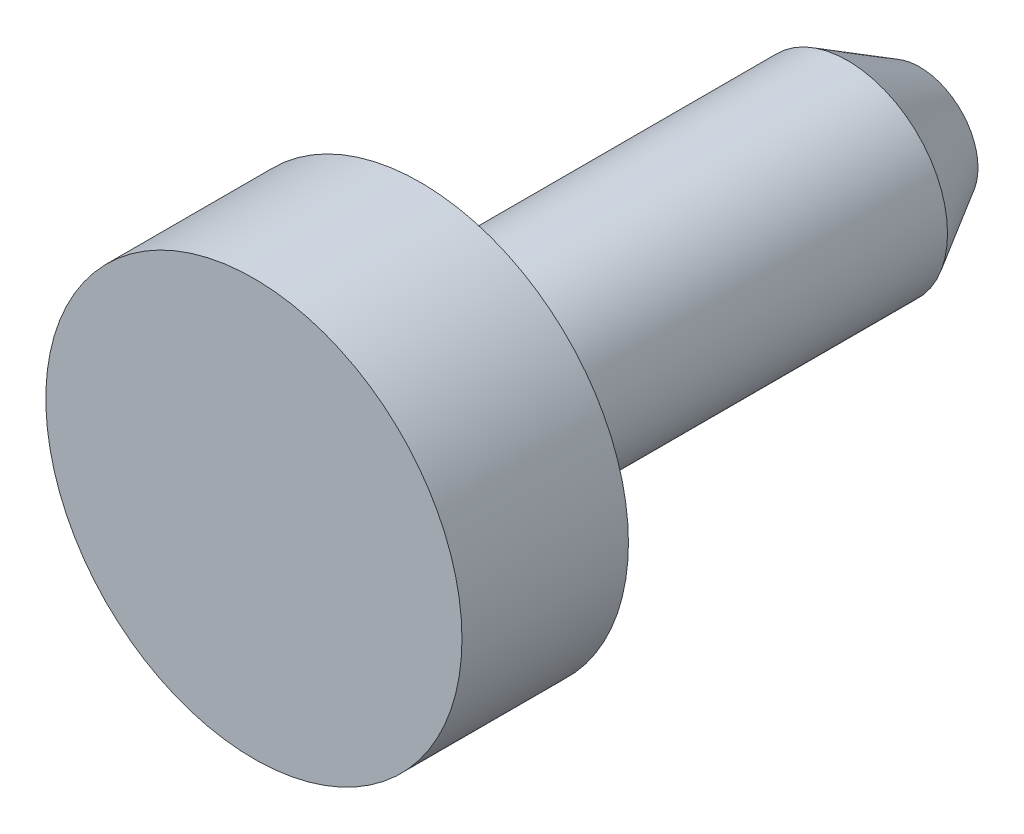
from build123d import *

# Parameters (mm, degrees)
CROQUIS1_R              = 2.5
SALIENTE_EXTRUIR1_DEPTH = 2
CROQUIS2_R              = 1.2
SALIENTE_EXTRUIR2_DEPTH = 6
CHAFL_N1_SIZE           = 0.5
CHAFL_N1_SIZE2          = 0.866025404


with BuildPart() as part:
    # Croquis1 → Saliente-Extruir1 (new body)
    with BuildSketch(Plane.XY):
        Circle(CROQUIS1_R)
    extrude(amount=SALIENTE_EXTRUIR1_DEPTH)

    # Croquis2 → Saliente-Extruir2 (add)
    with BuildSketch(Plane.XY):
        Circle(CROQUIS2_R)
    extrude(amount=-SALIENTE_EXTRUIR2_DEPTH)

    # Chafl_n1
    chafl_n1_edges = [part.edges().sort_by_distance(p)[0] for p in [
        (-1.2, 0, -6),
    ]]
    chafl_n1_side = [part.faces().sort_by_distance(p)[0] for p in [
        (0, 0, -6),
    ]]
    chamfer(chafl_n1_edges, length=CHAFL_N1_SIZE, length2=CHAFL_N1_SIZE2, reference=chafl_n1_side[0])


solid = part.part
